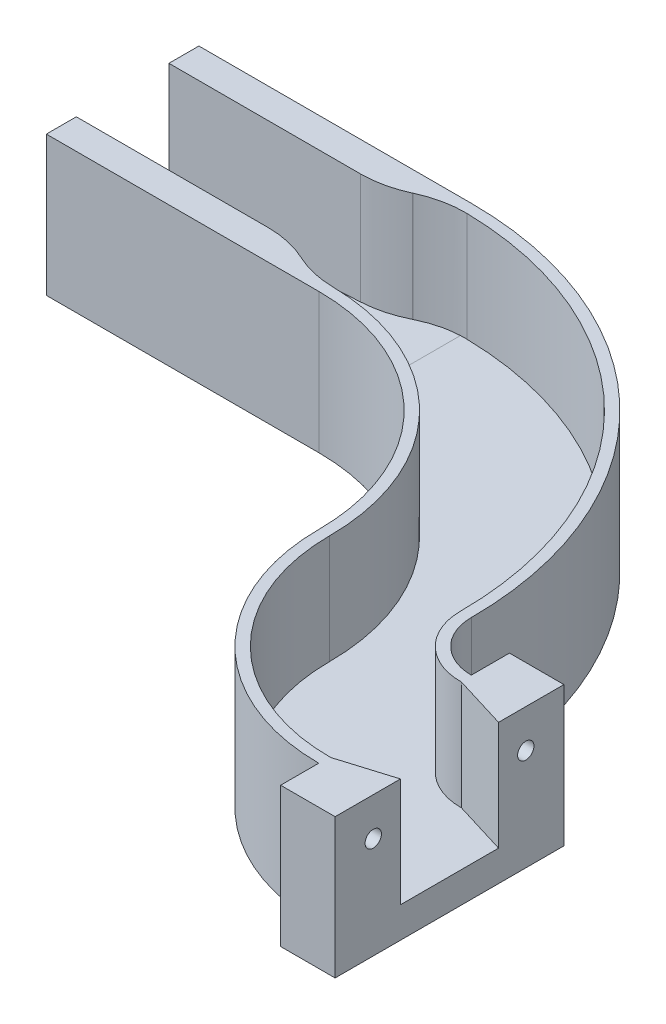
ISO-10303-21;
HEADER;
FILE_DESCRIPTION(('STEP AP214'),'2;1');
FILE_NAME('part.step','',(''),(''),'','','');
FILE_SCHEMA(('AUTOMOTIVE_DESIGN { 1 0 10303 214 1 1 1 1 }'));
ENDSEC;
DATA;
#1=APPLICATION_CONTEXT('core data for automotive mechanical design processes');
#2=APPLICATION_PROTOCOL_DEFINITION('international standard','automotive_design',2000,#1);
#3=PRODUCT_CONTEXT('',#1,'mechanical');
#4=PRODUCT('Part','Part','',(#3));
#5=PRODUCT_RELATED_PRODUCT_CATEGORY('part','',(#4));
#6=PRODUCT_DEFINITION_FORMATION('','',#4);
#7=PRODUCT_DEFINITION_CONTEXT('part definition',#1,'design');
#8=PRODUCT_DEFINITION('design','',#6,#7);
#9=PRODUCT_DEFINITION_SHAPE('','',#8);
#10=(LENGTH_UNIT() NAMED_UNIT(*) SI_UNIT(.MILLI.,.METRE.));
#11=(NAMED_UNIT(*) PLANE_ANGLE_UNIT() SI_UNIT($,.RADIAN.));
#12=(NAMED_UNIT(*) SI_UNIT($,.STERADIAN.) SOLID_ANGLE_UNIT());
#13=UNCERTAINTY_MEASURE_WITH_UNIT(LENGTH_MEASURE(1.E-05),#10,'distance_accuracy_value','');
#14=(GEOMETRIC_REPRESENTATION_CONTEXT(3) GLOBAL_UNCERTAINTY_ASSIGNED_CONTEXT((#13)) GLOBAL_UNIT_ASSIGNED_CONTEXT((#10,
#11,#12)) REPRESENTATION_CONTEXT('',''));
#15=CARTESIAN_POINT('',(0.,0.,0.));
#16=DIRECTION('',(0.,0.,1.));
#17=DIRECTION('',(1.,0.,0.));
#18=AXIS2_PLACEMENT_3D('',#15,#16,#17);
#19=CARTESIAN_POINT('',(-75.,35.,50.));
#20=DIRECTION('',(0.,-1.,0.));
#21=DIRECTION('',(0.,0.,-1.));
#22=AXIS2_PLACEMENT_3D('',#19,#20,#21);
#23=PLANE('',#22);
#24=CARTESIAN_POINT('',(-149.133179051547,35.,-9.49171374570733));
#25=DIRECTION('',(0.,-1.,0.));
#26=DIRECTION('',(0.,0.,-1.));
#27=AXIS2_PLACEMENT_3D('',#24,#25,#26);
#28=CIRCLE('',#27,18.5);
#29=CARTESIAN_POINT('',(-148.779515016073,34.9999999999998,-27.9883329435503));
#30=VERTEX_POINT('',#29);
#31=CARTESIAN_POINT('',(-149.972857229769,35.,-27.9726482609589));
#32=VERTEX_POINT('',#31);
#33=EDGE_CURVE('E448',#30,#32,#28,.F.);
#34=ORIENTED_EDGE('',*,*,#33,.T.);
#35=DIRECTION('',(0.,0.,1.));
#36=VECTOR('',#35,1.);
#37=CARTESIAN_POINT('',(-149.972857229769,35.,-7.50000000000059));
#38=LINE('',#37,#36);
#39=CARTESIAN_POINT('',(-149.972857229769,35.,-4.01364354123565));
#40=VERTEX_POINT('',#39);
#41=EDGE_CURVE('E476',#32,#40,#38,.T.);
#42=ORIENTED_EDGE('',*,*,#41,.T.);
#43=CARTESIAN_POINT('',(-149.100539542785,35.,-22.4930662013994));
#44=DIRECTION('',(0.,-1.,0.));
#45=DIRECTION('',(0.,0.,-1.));
#46=AXIS2_PLACEMENT_3D('',#43,#44,#45);
#47=CIRCLE('',#46,18.5);
#48=CARTESIAN_POINT('',(-149.385749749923,34.9999999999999,-3.99526484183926));
#49=VERTEX_POINT('',#48);
#50=EDGE_CURVE('E451',#40,#49,#47,.F.);
#51=ORIENTED_EDGE('',*,*,#50,.T.);
#52=CARTESIAN_POINT('',(-150.,34.9999999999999,35.8429976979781));
#53=DIRECTION('',(0.,-1.,0.));
#54=DIRECTION('',(1.,0.,0.));
#55=AXIS2_PLACEMENT_3D('',#52,#53,#54);
#56=CIRCLE('',#55,39.8429976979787);
#57=CARTESIAN_POINT('',(-110.157002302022,35.,35.8429976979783));
#58=VERTEX_POINT('',#57);
#59=EDGE_CURVE('E316',#49,#58,#56,.T.);
#60=ORIENTED_EDGE('',*,*,#59,.T.);
#61=CARTESIAN_POINT('',(-75.,35.,35.8429976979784));
#62=DIRECTION('',(0.,1.,0.));
#63=DIRECTION('',(0.,0.,1.));
#64=AXIS2_PLACEMENT_3D('',#61,#62,#63);
#65=CIRCLE('',#64,35.1570023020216);
#66=CARTESIAN_POINT('',(-74.8108943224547,35.,70.9994914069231));
#67=VERTEX_POINT('',#66);
#68=EDGE_CURVE('E355',#58,#67,#65,.T.);
#69=ORIENTED_EDGE('',*,*,#68,.T.);
#70=DIRECTION('',(-0.956304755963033,0.,0.292371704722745));
#71=VECTOR('',#70,1.);
#72=CARTESIAN_POINT('',(-69.1124517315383,35.,69.2573026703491));
#73=LINE('',#72,#71);
#74=CARTESIAN_POINT('',(-65.,35.,68.));
#75=VERTEX_POINT('',#74);
#76=EDGE_CURVE('E434',#67,#75,#73,.F.);
#77=ORIENTED_EDGE('',*,*,#76,.T.);
#78=DIRECTION('',(0.,0.,-1.));
#79=VECTOR('',#78,1.);
#80=CARTESIAN_POINT('',(-65.,35.,50.));
#81=LINE('',#80,#79);
#82=CARTESIAN_POINT('',(-65.,35.,50.));
#83=VERTEX_POINT('',#82);
#84=EDGE_CURVE('E403',#75,#83,#81,.T.);
#85=ORIENTED_EDGE('',*,*,#84,.T.);
#86=DIRECTION('',(0.956304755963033,0.,0.292371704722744));
#87=VECTOR('',#86,1.);
#88=CARTESIAN_POINT('',(-74.1451878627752,35.,47.2040354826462));
#89=LINE('',#88,#87);
#90=CARTESIAN_POINT('',(-74.8174433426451,35.,46.9985063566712));
#91=VERTEX_POINT('',#90);
#92=EDGE_CURVE('E428',#83,#91,#89,.F.);
#93=ORIENTED_EDGE('',*,*,#92,.T.);
#94=CARTESIAN_POINT('',(-75.,35.,35.8429976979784));
#95=DIRECTION('',(0.,1.,0.));
#96=DIRECTION('',(0.,0.,1.));
#97=AXIS2_PLACEMENT_3D('',#94,#95,#96);
#98=CIRCLE('',#97,11.1570023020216);
#99=CARTESIAN_POINT('',(-86.1570023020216,35.,35.8429976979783));
#100=VERTEX_POINT('',#99);
#101=EDGE_CURVE('E357',#100,#91,#98,.T.);
#102=ORIENTED_EDGE('',*,*,#101,.F.);
#103=CARTESIAN_POINT('',(-150.,34.9999999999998,35.8429976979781));
#104=DIRECTION('',(0.,-1.,0.));
#105=DIRECTION('',(1.,0.,0.));
#106=AXIS2_PLACEMENT_3D('',#103,#104,#105);
#107=CIRCLE('',#106,63.8429976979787);
#108=EDGE_CURVE('E318',#30,#100,#107,.T.);
#109=ORIENTED_EDGE('',*,*,#108,.F.);
#110=EDGE_LOOP('',(#34,#42,#51,#60,#69,#77,#85,#93,#102,#109));
#111=FACE_BOUND('',#110,.T.);
#112=ADVANCED_FACE('F35',(#111),#23,.F.);
#113=CARTESIAN_POINT('',(-75.,0.,0.));
#114=DIRECTION('',(1.,0.,0.));
#115=DIRECTION('',(0.,0.,-1.));
#116=AXIS2_PLACEMENT_3D('',#113,#114,#115);
#117=PLANE('',#116);
#118=DIRECTION('',(0.,-1.,0.));
#119=VECTOR('',#118,1.);
#120=CARTESIAN_POINT('',(-75.,29.3580211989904,45.));
#121=LINE('',#120,#119);
#122=CARTESIAN_POINT('',(-75.,55.,45.));
#123=VERTEX_POINT('',#122);
#124=CARTESIAN_POINT('',(-75.,49.5,45.));
#125=VERTEX_POINT('',#124);
#126=EDGE_CURVE('E323',#123,#125,#121,.T.);
#127=ORIENTED_EDGE('',*,*,#126,.F.);
#128=DIRECTION('',(0.,0.,-1.));
#129=VECTOR('',#128,1.);
#130=CARTESIAN_POINT('',(-75.,55.,38.));
#131=LINE('',#130,#129);
#132=CARTESIAN_POINT('',(-75.,55.,38.));
#133=VERTEX_POINT('',#132);
#134=EDGE_CURVE('E390',#123,#133,#131,.T.);
#135=ORIENTED_EDGE('',*,*,#134,.T.);
#136=DIRECTION('',(0.,-1.,0.));
#137=VECTOR('',#136,1.);
#138=CARTESIAN_POINT('',(-75.,29.3580211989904,38.));
#139=LINE('',#138,#137);
#140=CARTESIAN_POINT('',(-75.,29.3580211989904,38.));
#141=VERTEX_POINT('',#140);
#142=EDGE_CURVE('E379',#133,#141,#139,.T.);
#143=ORIENTED_EDGE('',*,*,#142,.T.);
#144=DIRECTION('',(0.,0.,1.));
#145=VECTOR('',#144,1.);
#146=CARTESIAN_POINT('',(-75.,29.3580211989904,80.));
#147=LINE('',#146,#145);
#148=CARTESIAN_POINT('',(-75.,29.3580211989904,45.));
#149=VERTEX_POINT('',#148);
#150=EDGE_CURVE('E384',#141,#149,#147,.T.);
#151=ORIENTED_EDGE('',*,*,#150,.T.);
#152=CARTESIAN_POINT('',(-75.,46.5,45.));
#153=VERTEX_POINT('',#152);
#154=EDGE_CURVE('E327',#153,#149,#121,.T.);
#155=ORIENTED_EDGE('',*,*,#154,.F.);
#156=CARTESIAN_POINT('',(-75.,48.,45.));
#157=DIRECTION('',(-1.,0.,0.));
#158=DIRECTION('',(0.,0.,1.));
#159=AXIS2_PLACEMENT_3D('',#156,#157,#158);
#160=CIRCLE('',#159,1.5);
#161=EDGE_CURVE('E372',#125,#153,#160,.T.);
#162=ORIENTED_EDGE('',*,*,#161,.F.);
#163=EDGE_LOOP('',(#127,#135,#143,#151,#155,#162));
#164=FACE_BOUND('',#163,.T.);
#165=ADVANCED_FACE('F536',(#164),#117,.F.);
#166=DIRECTION('',(0.,1.,0.));
#167=VECTOR('',#166,1.);
#168=CARTESIAN_POINT('',(-75.,55.,73.));
#169=LINE('',#168,#167);
#170=CARTESIAN_POINT('',(-75.,29.3580211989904,73.));
#171=VERTEX_POINT('',#170);
#172=CARTESIAN_POINT('',(-75.,46.5,73.));
#173=VERTEX_POINT('',#172);
#174=EDGE_CURVE('E328',#171,#173,#169,.T.);
#175=ORIENTED_EDGE('',*,*,#174,.F.);
#176=CARTESIAN_POINT('',(-75.,29.3580211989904,80.));
#177=VERTEX_POINT('',#176);
#178=EDGE_CURVE('E382',#171,#177,#147,.T.);
#179=ORIENTED_EDGE('',*,*,#178,.T.);
#180=DIRECTION('',(0.,1.,0.));
#181=VECTOR('',#180,1.);
#182=CARTESIAN_POINT('',(-75.,55.,80.));
#183=LINE('',#182,#181);
#184=CARTESIAN_POINT('',(-75.,55.,80.));
#185=VERTEX_POINT('',#184);
#186=EDGE_CURVE('E386',#177,#185,#183,.T.);
#187=ORIENTED_EDGE('',*,*,#186,.T.);
#188=DIRECTION('',(0.,0.,-1.));
#189=VECTOR('',#188,1.);
#190=CARTESIAN_POINT('',(-75.,55.,68.));
#191=LINE('',#190,#189);
#192=CARTESIAN_POINT('',(-75.,55.,73.));
#193=VERTEX_POINT('',#192);
#194=EDGE_CURVE('E388',#185,#193,#191,.T.);
#195=ORIENTED_EDGE('',*,*,#194,.T.);
#196=CARTESIAN_POINT('',(-75.,49.5,73.));
#197=VERTEX_POINT('',#196);
#198=EDGE_CURVE('E332',#197,#193,#169,.T.);
#199=ORIENTED_EDGE('',*,*,#198,.F.);
#200=CARTESIAN_POINT('',(-75.,48.,73.));
#201=DIRECTION('',(-1.,0.,0.));
#202=DIRECTION('',(0.,0.,1.));
#203=AXIS2_PLACEMENT_3D('',#200,#201,#202);
#204=CIRCLE('',#203,1.5);
#205=EDGE_CURVE('E369',#173,#197,#204,.T.);
#206=ORIENTED_EDGE('',*,*,#205,.F.);
#207=EDGE_LOOP('',(#175,#179,#187,#195,#199,#206));
#208=FACE_BOUND('',#207,.T.);
#209=ADVANCED_FACE('F542',(#208),#117,.F.);
#210=CARTESIAN_POINT('',(-65.,0.,0.));
#211=DIRECTION('',(1.,0.,0.));
#212=DIRECTION('',(0.,0.,-1.));
#213=AXIS2_PLACEMENT_3D('',#210,#211,#212);
#214=PLANE('',#213);
#215=DIRECTION('',(0.,1.,0.));
#216=VECTOR('',#215,1.);
#217=CARTESIAN_POINT('',(-65.,55.,80.));
#218=LINE('',#217,#216);
#219=CARTESIAN_POINT('',(-65.,29.3580211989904,80.));
#220=VERTEX_POINT('',#219);
#221=CARTESIAN_POINT('',(-65.,55.,80.));
#222=VERTEX_POINT('',#221);
#223=EDGE_CURVE('E397',#220,#222,#218,.T.);
#224=ORIENTED_EDGE('',*,*,#223,.F.);
#225=DIRECTION('',(0.,0.,1.));
#226=VECTOR('',#225,1.);
#227=CARTESIAN_POINT('',(-65.,29.3580211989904,80.));
#228=LINE('',#227,#226);
#229=CARTESIAN_POINT('',(-65.,29.3580211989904,38.));
#230=VERTEX_POINT('',#229);
#231=EDGE_CURVE('E395',#230,#220,#228,.T.);
#232=ORIENTED_EDGE('',*,*,#231,.F.);
#233=DIRECTION('',(0.,-1.,0.));
#234=VECTOR('',#233,1.);
#235=CARTESIAN_POINT('',(-65.,29.3580211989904,38.));
#236=LINE('',#235,#234);
#237=CARTESIAN_POINT('',(-65.,55.,38.));
#238=VERTEX_POINT('',#237);
#239=EDGE_CURVE('E375',#238,#230,#236,.T.);
#240=ORIENTED_EDGE('',*,*,#239,.F.);
#241=DIRECTION('',(0.,0.,-1.));
#242=VECTOR('',#241,1.);
#243=CARTESIAN_POINT('',(-65.,55.,38.));
#244=LINE('',#243,#242);
#245=CARTESIAN_POINT('',(-65.,55.,50.));
#246=VERTEX_POINT('',#245);
#247=EDGE_CURVE('E383',#246,#238,#244,.T.);
#248=ORIENTED_EDGE('',*,*,#247,.F.);
#249=DIRECTION('',(0.,1.,0.));
#250=VECTOR('',#249,1.);
#251=CARTESIAN_POINT('',(-65.,55.,50.));
#252=LINE('',#251,#250);
#253=EDGE_CURVE('E406',#83,#246,#252,.T.);
#254=ORIENTED_EDGE('',*,*,#253,.F.);
#255=ORIENTED_EDGE('',*,*,#84,.F.);
#256=DIRECTION('',(0.,-1.,0.));
#257=VECTOR('',#256,1.);
#258=CARTESIAN_POINT('',(-65.,35.,68.));
#259=LINE('',#258,#257);
#260=CARTESIAN_POINT('',(-65.,55.,68.));
#261=VERTEX_POINT('',#260);
#262=EDGE_CURVE('E400',#261,#75,#259,.T.);
#263=ORIENTED_EDGE('',*,*,#262,.F.);
#264=DIRECTION('',(0.,0.,-1.));
#265=VECTOR('',#264,1.);
#266=CARTESIAN_POINT('',(-65.,55.,68.));
#267=LINE('',#266,#265);
#268=EDGE_CURVE('E40',#222,#261,#267,.T.);
#269=ORIENTED_EDGE('',*,*,#268,.F.);
#270=EDGE_LOOP('',(#224,#232,#240,#248,#254,#255,#263,#269));
#271=FACE_BOUND('',#270,.T.);
#272=CARTESIAN_POINT('',(-65.,48.,45.));
#273=DIRECTION('',(-1.,0.,0.));
#274=DIRECTION('',(0.,0.,1.));
#275=AXIS2_PLACEMENT_3D('',#272,#273,#274);
#276=CIRCLE('',#275,1.5);
#277=CARTESIAN_POINT('',(-65.,48.,46.5));
#278=VERTEX_POINT('',#277);
#279=EDGE_CURVE('E368',#278,#278,#276,.T.);
#280=ORIENTED_EDGE('',*,*,#279,.T.);
#281=EDGE_LOOP('',(#280));
#282=FACE_BOUND('',#281,.T.);
#283=CARTESIAN_POINT('',(-65.,48.,73.));
#284=DIRECTION('',(-1.,0.,0.));
#285=DIRECTION('',(0.,0.,1.));
#286=AXIS2_PLACEMENT_3D('',#283,#284,#285);
#287=CIRCLE('',#286,1.5);
#288=CARTESIAN_POINT('',(-65.,48.,74.5));
#289=VERTEX_POINT('',#288);
#290=EDGE_CURVE('E364',#289,#289,#287,.T.);
#291=ORIENTED_EDGE('',*,*,#290,.T.);
#292=EDGE_LOOP('',(#291));
#293=FACE_BOUND('',#292,.T.);
#294=ADVANCED_FACE('F562',(#271,#282,#293),#214,.T.);
#295=CARTESIAN_POINT('',(-75.,29.3580211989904,38.));
#296=DIRECTION('',(0.,0.,1.));
#297=DIRECTION('',(1.,0.,0.));
#298=AXIS2_PLACEMENT_3D('',#295,#296,#297);
#299=PLANE('',#298);
#300=ORIENTED_EDGE('',*,*,#239,.T.);
#301=DIRECTION('',(1.,0.,0.));
#302=VECTOR('',#301,1.);
#303=CARTESIAN_POINT('',(-75.,29.3580211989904,38.));
#304=LINE('',#303,#302);
#305=EDGE_CURVE('E418',#141,#230,#304,.T.);
#306=ORIENTED_EDGE('',*,*,#305,.F.);
#307=ORIENTED_EDGE('',*,*,#142,.F.);
#308=DIRECTION('',(1.,0.,0.));
#309=VECTOR('',#308,1.);
#310=CARTESIAN_POINT('',(-75.,55.,38.));
#311=LINE('',#310,#309);
#312=EDGE_CURVE('E392',#133,#238,#311,.T.);
#313=ORIENTED_EDGE('',*,*,#312,.T.);
#314=EDGE_LOOP('',(#300,#306,#307,#313));
#315=FACE_BOUND('',#314,.T.);
#316=ADVANCED_FACE('F558',(#315),#299,.F.);
#317=CARTESIAN_POINT('',(-75.,29.3580211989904,80.));
#318=DIRECTION('',(0.,1.,0.));
#319=DIRECTION('',(0.,0.,1.));
#320=AXIS2_PLACEMENT_3D('',#317,#318,#319);
#321=PLANE('',#320);
#322=ORIENTED_EDGE('',*,*,#231,.T.);
#323=DIRECTION('',(1.,0.,0.));
#324=VECTOR('',#323,1.);
#325=CARTESIAN_POINT('',(-75.,29.3580211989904,80.));
#326=LINE('',#325,#324);
#327=EDGE_CURVE('E415',#177,#220,#326,.T.);
#328=ORIENTED_EDGE('',*,*,#327,.F.);
#329=ORIENTED_EDGE('',*,*,#178,.F.);
#330=CARTESIAN_POINT('',(-75.,29.3580211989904,35.8429976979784));
#331=DIRECTION('',(0.,1.,0.));
#332=DIRECTION('',(0.,0.,1.));
#333=AXIS2_PLACEMENT_3D('',#330,#331,#332);
#334=CIRCLE('',#333,37.1570023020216);
#335=CARTESIAN_POINT('',(-112.157002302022,29.3580211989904,35.8429976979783));
#336=VERTEX_POINT('',#335);
#337=EDGE_CURVE('E347',#336,#171,#334,.T.);
#338=ORIENTED_EDGE('',*,*,#337,.F.);
#339=CARTESIAN_POINT('',(-150.,29.3580211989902,35.8429976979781));
#340=DIRECTION('',(0.,-1.,0.));
#341=DIRECTION('',(1.,0.,0.));
#342=AXIS2_PLACEMENT_3D('',#339,#340,#341);
#343=CIRCLE('',#342,37.8429976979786);
#344=CARTESIAN_POINT('',(-150.,29.3580211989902,-2.0000000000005));
#345=VERTEX_POINT('',#344);
#346=EDGE_CURVE('E308',#345,#336,#343,.T.);
#347=ORIENTED_EDGE('',*,*,#346,.F.);
#348=DIRECTION('',(1.,0.,0.));
#349=VECTOR('',#348,1.);
#350=CARTESIAN_POINT('',(-200.,29.3580211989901,-2.0000000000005));
#351=LINE('',#350,#349);
#352=CARTESIAN_POINT('',(-200.,29.3580211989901,-2.0000000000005));
#353=VERTEX_POINT('',#352);
#354=EDGE_CURVE('E287',#353,#345,#351,.T.);
#355=ORIENTED_EDGE('',*,*,#354,.F.);
#356=DIRECTION('',(0.,0.,1.));
#357=VECTOR('',#356,1.);
#358=CARTESIAN_POINT('',(-200.,29.35802119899,-30.0000000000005));
#359=LINE('',#358,#357);
#360=CARTESIAN_POINT('',(-200.,29.35802119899,-30.0000000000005));
#361=VERTEX_POINT('',#360);
#362=EDGE_CURVE('E283',#361,#353,#359,.T.);
#363=ORIENTED_EDGE('',*,*,#362,.F.);
#364=DIRECTION('',(1.,0.,0.));
#365=VECTOR('',#364,1.);
#366=CARTESIAN_POINT('',(-200.,29.35802119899,-30.0000000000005));
#367=LINE('',#366,#365);
#368=CARTESIAN_POINT('',(-150.,29.3580211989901,-30.0000000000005));
#369=VERTEX_POINT('',#368);
#370=EDGE_CURVE('E290',#361,#369,#367,.T.);
#371=ORIENTED_EDGE('',*,*,#370,.T.);
#372=CARTESIAN_POINT('',(-150.,29.3580211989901,35.8429976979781));
#373=DIRECTION('',(0.,-1.,0.));
#374=DIRECTION('',(1.,0.,0.));
#375=AXIS2_PLACEMENT_3D('',#372,#373,#374);
#376=CIRCLE('',#375,65.8429976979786);
#377=CARTESIAN_POINT('',(-84.1570023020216,29.3580211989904,35.8429976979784));
#378=VERTEX_POINT('',#377);
#379=EDGE_CURVE('E305',#369,#378,#376,.T.);
#380=ORIENTED_EDGE('',*,*,#379,.T.);
#381=CARTESIAN_POINT('',(-75.,29.3580211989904,35.8429976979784));
#382=DIRECTION('',(0.,1.,0.));
#383=DIRECTION('',(0.,0.,1.));
#384=AXIS2_PLACEMENT_3D('',#381,#382,#383);
#385=CIRCLE('',#384,9.15700230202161);
#386=EDGE_CURVE('E344',#378,#149,#385,.T.);
#387=ORIENTED_EDGE('',*,*,#386,.T.);
#388=ORIENTED_EDGE('',*,*,#150,.F.);
#389=ORIENTED_EDGE('',*,*,#305,.T.);
#390=EDGE_LOOP('',(#322,#328,#329,#338,#347,#355,#363,#371,#380,#387,#388,#389));
#391=FACE_BOUND('',#390,.T.);
#392=ADVANCED_FACE('F554',(#391),#321,.F.);
#393=CARTESIAN_POINT('',(-75.,55.,80.));
#394=DIRECTION('',(0.,0.,-1.));
#395=DIRECTION('',(-1.,0.,0.));
#396=AXIS2_PLACEMENT_3D('',#393,#394,#395);
#397=PLANE('',#396);
#398=ORIENTED_EDGE('',*,*,#223,.T.);
#399=DIRECTION('',(1.,0.,0.));
#400=VECTOR('',#399,1.);
#401=CARTESIAN_POINT('',(-75.,55.,80.));
#402=LINE('',#401,#400);
#403=EDGE_CURVE('E412',#185,#222,#402,.T.);
#404=ORIENTED_EDGE('',*,*,#403,.F.);
#405=ORIENTED_EDGE('',*,*,#186,.F.);
#406=ORIENTED_EDGE('',*,*,#327,.T.);
#407=EDGE_LOOP('',(#398,#404,#405,#406));
#408=FACE_BOUND('',#407,.T.);
#409=ADVANCED_FACE('F551',(#408),#397,.F.);
#410=CARTESIAN_POINT('',(-75.,55.,68.));
#411=DIRECTION('',(0.,-1.,0.));
#412=DIRECTION('',(0.,0.,-1.));
#413=AXIS2_PLACEMENT_3D('',#410,#411,#412);
#414=PLANE('',#413);
#415=DIRECTION('',(-0.906307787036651,0.,-0.422618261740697));
#416=VECTOR('',#415,1.);
#417=CARTESIAN_POINT('',(-160.722534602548,55.,-7.50000000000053));
#418=LINE('',#417,#416);
#419=CARTESIAN_POINT('',(-156.918977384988,55.,-5.72637214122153));
#420=VERTEX_POINT('',#419);
#421=CARTESIAN_POINT('',(-157.00544801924,55.,-5.76669406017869));
#422=VERTEX_POINT('',#421);
#423=EDGE_CURVE('E436',#420,#422,#418,.T.);
#424=ORIENTED_EDGE('',*,*,#423,.T.);
#425=CARTESIAN_POINT('',(-164.823885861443,55.,10.9999999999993));
#426=DIRECTION('',(0.,-1.,0.));
#427=DIRECTION('',(0.,0.,-1.));
#428=AXIS2_PLACEMENT_3D('',#425,#426,#427);
#429=CIRCLE('',#428,18.5);
#430=CARTESIAN_POINT('',(-164.823885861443,54.9999999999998,-7.50000000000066));
#431=VERTEX_POINT('',#430);
#432=EDGE_CURVE('E273',#422,#431,#429,.F.);
#433=ORIENTED_EDGE('',*,*,#432,.T.);
#434=DIRECTION('',(1.,0.,0.));
#435=VECTOR('',#434,1.);
#436=CARTESIAN_POINT('',(-200.,54.9999999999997,-7.50000000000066));
#437=LINE('',#436,#435);
#438=CARTESIAN_POINT('',(-200.,54.9999999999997,-7.50000000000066));
#439=VERTEX_POINT('',#438);
#440=EDGE_CURVE('E264',#439,#431,#437,.T.);
#441=ORIENTED_EDGE('',*,*,#440,.F.);
#442=DIRECTION('',(0.,0.,-1.));
#443=VECTOR('',#442,1.);
#444=CARTESIAN_POINT('',(-200.,54.9999999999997,-2.0000000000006));
#445=LINE('',#444,#443);
#446=CARTESIAN_POINT('',(-200.,54.9999999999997,-2.0000000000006));
#447=VERTEX_POINT('',#446);
#448=EDGE_CURVE('E247',#447,#439,#445,.T.);
#449=ORIENTED_EDGE('',*,*,#448,.F.);
#450=DIRECTION('',(1.,0.,0.));
#451=VECTOR('',#450,1.);
#452=CARTESIAN_POINT('',(-200.,54.9999999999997,-2.0000000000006));
#453=LINE('',#452,#451);
#454=CARTESIAN_POINT('',(-150.,54.9999999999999,-2.0000000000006));
#455=VERTEX_POINT('',#454);
#456=EDGE_CURVE('E259',#447,#455,#453,.T.);
#457=ORIENTED_EDGE('',*,*,#456,.T.);
#458=CARTESIAN_POINT('',(-150.,54.9999999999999,35.8429976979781));
#459=DIRECTION('',(0.,-1.,0.));
#460=DIRECTION('',(1.,0.,0.));
#461=AXIS2_PLACEMENT_3D('',#458,#459,#460);
#462=CIRCLE('',#461,37.8429976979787);
#463=CARTESIAN_POINT('',(-112.157002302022,55.,35.8429976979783));
#464=VERTEX_POINT('',#463);
#465=EDGE_CURVE('E311',#455,#464,#462,.T.);
#466=ORIENTED_EDGE('',*,*,#465,.T.);
#467=CARTESIAN_POINT('',(-75.,55.,35.8429976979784));
#468=DIRECTION('',(0.,1.,0.));
#469=DIRECTION('',(0.,0.,1.));
#470=AXIS2_PLACEMENT_3D('',#467,#468,#469);
#471=CIRCLE('',#470,37.1570023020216);
#472=EDGE_CURVE('E350',#464,#193,#471,.T.);
#473=ORIENTED_EDGE('',*,*,#472,.T.);
#474=ORIENTED_EDGE('',*,*,#194,.F.);
#475=ORIENTED_EDGE('',*,*,#403,.T.);
#476=ORIENTED_EDGE('',*,*,#268,.T.);
#477=DIRECTION('',(0.956304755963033,0.,-0.292371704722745));
#478=VECTOR('',#477,1.);
#479=CARTESIAN_POINT('',(-75.,55.,71.0573068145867));
#480=LINE('',#479,#478);
#481=CARTESIAN_POINT('',(-74.8108943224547,55.,70.9994914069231));
#482=VERTEX_POINT('',#481);
#483=EDGE_CURVE('E422',#261,#482,#480,.F.);
#484=ORIENTED_EDGE('',*,*,#483,.T.);
#485=CARTESIAN_POINT('',(-75.,55.,35.8429976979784));
#486=DIRECTION('',(0.,1.,0.));
#487=DIRECTION('',(0.,0.,1.));
#488=AXIS2_PLACEMENT_3D('',#485,#486,#487);
#489=CIRCLE('',#488,35.1570023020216);
#490=CARTESIAN_POINT('',(-110.157002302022,55.,35.8429976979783));
#491=VERTEX_POINT('',#490);
#492=EDGE_CURVE('E353',#491,#482,#489,.T.);
#493=ORIENTED_EDGE('',*,*,#492,.F.);
#494=CARTESIAN_POINT('',(-150.,54.9999999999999,35.8429976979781));
#495=DIRECTION('',(0.,-1.,0.));
#496=DIRECTION('',(1.,0.,0.));
#497=AXIS2_PLACEMENT_3D('',#494,#495,#496);
#498=CIRCLE('',#497,39.8429976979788);
#499=CARTESIAN_POINT('',(-149.385749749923,54.9999999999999,-3.99526484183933));
#500=VERTEX_POINT('',#499);
#501=EDGE_CURVE('E314',#500,#491,#498,.T.);
#502=ORIENTED_EDGE('',*,*,#501,.F.);
#503=CARTESIAN_POINT('',(-149.100539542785,55.,-22.4930662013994));
#504=DIRECTION('',(0.,-1.,0.));
#505=DIRECTION('',(0.,0.,-1.));
#506=AXIS2_PLACEMENT_3D('',#503,#504,#505);
#507=CIRCLE('',#506,18.5);
#508=EDGE_CURVE('E466',#500,#420,#507,.T.);
#509=ORIENTED_EDGE('',*,*,#508,.T.);
#510=EDGE_LOOP('',(#424,#433,#441,#449,#457,#466,#473,#474,#475,#476,#484,#493,#502,#509));
#511=FACE_BOUND('',#510,.T.);
#512=ADVANCED_FACE('F271',(#511),#414,.F.);
#513=CARTESIAN_POINT('',(-75.,55.,38.));
#514=DIRECTION('',(0.,-1.,0.));
#515=DIRECTION('',(0.,0.,-1.));
#516=AXIS2_PLACEMENT_3D('',#513,#514,#515);
#517=PLANE('',#516);
#518=DIRECTION('',(-1.,0.,0.));
#519=VECTOR('',#518,1.);
#520=CARTESIAN_POINT('',(-150.,54.9999999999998,-24.5000000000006));
#521=LINE('',#520,#519);
#522=CARTESIAN_POINT('',(-164.823885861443,54.9999999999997,-24.5000000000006));
#523=VERTEX_POINT('',#522);
#524=CARTESIAN_POINT('',(-200.,54.9999999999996,-24.5000000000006));
#525=VERTEX_POINT('',#524);
#526=EDGE_CURVE('E268',#523,#525,#521,.T.);
#527=ORIENTED_EDGE('',*,*,#526,.F.);
#528=CARTESIAN_POINT('',(-164.823885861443,55.,-43.0000000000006));
#529=DIRECTION('',(0.,-1.,0.));
#530=DIRECTION('',(0.,0.,-1.));
#531=AXIS2_PLACEMENT_3D('',#528,#529,#530);
#532=CIRCLE('',#531,18.5);
#533=CARTESIAN_POINT('',(-157.00544801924,55.,-26.2333059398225));
#534=VERTEX_POINT('',#533);
#535=EDGE_CURVE('E459',#523,#534,#532,.F.);
#536=ORIENTED_EDGE('',*,*,#535,.T.);
#537=DIRECTION('',(0.906307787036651,0.,-0.422618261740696));
#538=VECTOR('',#537,1.);
#539=CARTESIAN_POINT('',(-160.722534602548,55.,-24.5000000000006));
#540=LINE('',#539,#538);
#541=CARTESIAN_POINT('',(-156.95161689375,55.,-26.2584078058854));
#542=VERTEX_POINT('',#541);
#543=EDGE_CURVE('E438',#534,#542,#540,.T.);
#544=ORIENTED_EDGE('',*,*,#543,.T.);
#545=CARTESIAN_POINT('',(-149.133179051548,55.,-9.49171374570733));
#546=DIRECTION('',(0.,-1.,0.));
#547=DIRECTION('',(0.,0.,-1.));
#548=AXIS2_PLACEMENT_3D('',#545,#546,#547);
#549=CIRCLE('',#548,18.5);
#550=CARTESIAN_POINT('',(-148.779515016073,54.9999999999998,-27.9883329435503));
#551=VERTEX_POINT('',#550);
#552=EDGE_CURVE('E468',#542,#551,#549,.T.);
#553=ORIENTED_EDGE('',*,*,#552,.T.);
#554=CARTESIAN_POINT('',(-150.,54.9999999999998,35.8429976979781));
#555=DIRECTION('',(0.,-1.,0.));
#556=DIRECTION('',(1.,0.,0.));
#557=AXIS2_PLACEMENT_3D('',#554,#555,#556);
#558=CIRCLE('',#557,63.8429976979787);
#559=CARTESIAN_POINT('',(-86.1570023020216,55.,35.8429976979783));
#560=VERTEX_POINT('',#559);
#561=EDGE_CURVE('E320',#551,#560,#558,.T.);
#562=ORIENTED_EDGE('',*,*,#561,.T.);
#563=CARTESIAN_POINT('',(-75.,55.,35.8429976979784));
#564=DIRECTION('',(0.,1.,0.));
#565=DIRECTION('',(0.,0.,1.));
#566=AXIS2_PLACEMENT_3D('',#563,#564,#565);
#567=CIRCLE('',#566,11.1570023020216);
#568=CARTESIAN_POINT('',(-74.8174433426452,55.,46.9985063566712));
#569=VERTEX_POINT('',#568);
#570=EDGE_CURVE('E359',#560,#569,#567,.T.);
#571=ORIENTED_EDGE('',*,*,#570,.T.);
#572=DIRECTION('',(-0.956304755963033,0.,-0.292371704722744));
#573=VECTOR('',#572,1.);
#574=CARTESIAN_POINT('',(-75.,55.,46.9426931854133));
#575=LINE('',#574,#573);
#576=EDGE_CURVE('E420',#569,#246,#575,.F.);
#577=ORIENTED_EDGE('',*,*,#576,.T.);
#578=ORIENTED_EDGE('',*,*,#247,.T.);
#579=ORIENTED_EDGE('',*,*,#312,.F.);
#580=ORIENTED_EDGE('',*,*,#134,.F.);
#581=CARTESIAN_POINT('',(-75.,55.,35.8429976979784));
#582=DIRECTION('',(0.,1.,0.));
#583=DIRECTION('',(0.,0.,1.));
#584=AXIS2_PLACEMENT_3D('',#581,#582,#583);
#585=CIRCLE('',#584,9.15700230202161);
#586=CARTESIAN_POINT('',(-84.1570023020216,55.,35.8429976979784));
#587=VERTEX_POINT('',#586);
#588=EDGE_CURVE('E361',#587,#123,#585,.T.);
#589=ORIENTED_EDGE('',*,*,#588,.F.);
#590=CARTESIAN_POINT('',(-150.,54.9999999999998,35.8429976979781));
#591=DIRECTION('',(0.,-1.,0.));
#592=DIRECTION('',(1.,0.,0.));
#593=AXIS2_PLACEMENT_3D('',#590,#591,#592);
#594=CIRCLE('',#593,65.8429976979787);
#595=CARTESIAN_POINT('',(-150.,54.9999999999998,-30.0000000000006));
#596=VERTEX_POINT('',#595);
#597=EDGE_CURVE('E302',#596,#587,#594,.T.);
#598=ORIENTED_EDGE('',*,*,#597,.F.);
#599=DIRECTION('',(1.,0.,0.));
#600=VECTOR('',#599,1.);
#601=CARTESIAN_POINT('',(-200.,54.9999999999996,-30.0000000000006));
#602=LINE('',#601,#600);
#603=CARTESIAN_POINT('',(-200.,54.9999999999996,-30.0000000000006));
#604=VERTEX_POINT('',#603);
#605=EDGE_CURVE('E293',#604,#596,#602,.T.);
#606=ORIENTED_EDGE('',*,*,#605,.F.);
#607=DIRECTION('',(0.,0.,-1.));
#608=VECTOR('',#607,1.);
#609=CARTESIAN_POINT('',(-200.,54.9999999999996,-28.0000000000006));
#610=LINE('',#609,#608);
#611=EDGE_CURVE('E279',#525,#604,#610,.T.);
#612=ORIENTED_EDGE('',*,*,#611,.F.);
#613=EDGE_LOOP('',(#527,#536,#544,#553,#562,#571,#577,#578,#579,#580,#589,#598,#606,#612));
#614=FACE_BOUND('',#613,.T.);
#615=ADVANCED_FACE('F547',(#614),#517,.F.);
#616=CARTESIAN_POINT('',(-75.,48.,45.));
#617=DIRECTION('',(1.,0.,0.));
#618=DIRECTION('',(0.,0.,-1.));
#619=AXIS2_PLACEMENT_3D('',#616,#617,#618);
#620=CYLINDRICAL_SURFACE('',#619,1.5);
#621=ORIENTED_EDGE('',*,*,#161,.T.);
#622=EDGE_CURVE('E376',#153,#125,#160,.T.);
#623=ORIENTED_EDGE('',*,*,#622,.T.);
#624=EDGE_LOOP('',(#621,#623));
#625=FACE_BOUND('',#624,.T.);
#626=ORIENTED_EDGE('',*,*,#279,.F.);
#627=EDGE_LOOP('',(#626));
#628=FACE_BOUND('',#627,.T.);
#629=ADVANCED_FACE('F633',(#625,#628),#620,.F.);
#630=CARTESIAN_POINT('',(-75.,48.,73.));
#631=DIRECTION('',(1.,0.,0.));
#632=DIRECTION('',(0.,0.,-1.));
#633=AXIS2_PLACEMENT_3D('',#630,#631,#632);
#634=CYLINDRICAL_SURFACE('',#633,1.5);
#635=EDGE_CURVE('E365',#197,#173,#204,.T.);
#636=ORIENTED_EDGE('',*,*,#635,.T.);
#637=ORIENTED_EDGE('',*,*,#205,.T.);
#638=EDGE_LOOP('',(#636,#637));
#639=FACE_BOUND('',#638,.T.);
#640=ORIENTED_EDGE('',*,*,#290,.F.);
#641=EDGE_LOOP('',(#640));
#642=FACE_BOUND('',#641,.T.);
#643=ADVANCED_FACE('F660',(#639,#642),#634,.F.);
#644=CARTESIAN_POINT('',(-75.,0.,0.));
#645=DIRECTION('',(1.,0.,0.));
#646=DIRECTION('',(0.,0.,-1.));
#647=AXIS2_PLACEMENT_3D('',#644,#645,#646);
#648=PLANE('',#647);
#649=ORIENTED_EDGE('',*,*,#622,.F.);
#650=EDGE_CURVE('E322',#125,#153,#121,.T.);
#651=ORIENTED_EDGE('',*,*,#650,.F.);
#652=EDGE_LOOP('',(#649,#651));
#653=FACE_BOUND('',#652,.T.);
#654=ADVANCED_FACE('F630',(#653),#648,.T.);
#655=ORIENTED_EDGE('',*,*,#635,.F.);
#656=EDGE_CURVE('E326',#173,#197,#169,.T.);
#657=ORIENTED_EDGE('',*,*,#656,.F.);
#658=EDGE_LOOP('',(#655,#657));
#659=FACE_BOUND('',#658,.T.);
#660=ADVANCED_FACE('F659',(#659),#648,.T.);
#661=CARTESIAN_POINT('',(-75.,0.429999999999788,35.8429976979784));
#662=DIRECTION('',(0.,1.,0.));
#663=DIRECTION('',(0.,0.,1.));
#664=AXIS2_PLACEMENT_3D('',#661,#662,#663);
#665=CYLINDRICAL_SURFACE('',#664,9.15700230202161);
#666=ORIENTED_EDGE('',*,*,#588,.T.);
#667=ORIENTED_EDGE('',*,*,#126,.T.);
#668=ORIENTED_EDGE('',*,*,#650,.T.);
#669=ORIENTED_EDGE('',*,*,#154,.T.);
#670=ORIENTED_EDGE('',*,*,#386,.F.);
#671=DIRECTION('',(0.,-1.,0.));
#672=VECTOR('',#671,1.);
#673=CARTESIAN_POINT('',(-84.1570023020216,29.3580211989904,35.8429976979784));
#674=LINE('',#673,#672);
#675=EDGE_CURVE('E331',#587,#378,#674,.T.);
#676=ORIENTED_EDGE('',*,*,#675,.F.);
#677=EDGE_LOOP('',(#666,#667,#668,#669,#670,#676));
#678=FACE_BOUND('',#677,.T.);
#679=ADVANCED_FACE('F627',(#678),#665,.F.);
#680=CARTESIAN_POINT('',(-75.,0.429999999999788,35.8429976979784));
#681=DIRECTION('',(0.,1.,0.));
#682=DIRECTION('',(0.,0.,1.));
#683=AXIS2_PLACEMENT_3D('',#680,#681,#682);
#684=CYLINDRICAL_SURFACE('',#683,11.1570023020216);
#685=ORIENTED_EDGE('',*,*,#101,.T.);
#686=DIRECTION('',(0.,1.,0.));
#687=VECTOR('',#686,1.);
#688=CARTESIAN_POINT('',(-74.8174433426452,45.,46.9985063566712));
#689=LINE('',#688,#687);
#690=EDGE_CURVE('E425',#91,#569,#689,.T.);
#691=ORIENTED_EDGE('',*,*,#690,.T.);
#692=ORIENTED_EDGE('',*,*,#570,.F.);
#693=DIRECTION('',(0.,1.,0.));
#694=VECTOR('',#693,1.);
#695=CARTESIAN_POINT('',(-86.1570023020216,55.,35.8429976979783));
#696=LINE('',#695,#694);
#697=EDGE_CURVE('E341',#100,#560,#696,.T.);
#698=ORIENTED_EDGE('',*,*,#697,.F.);
#699=EDGE_LOOP('',(#685,#691,#692,#698));
#700=FACE_BOUND('',#699,.T.);
#701=ADVANCED_FACE('F663',(#700),#684,.T.);
#702=CARTESIAN_POINT('',(-75.,0.429999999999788,35.8429976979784));
#703=DIRECTION('',(0.,1.,0.));
#704=DIRECTION('',(0.,0.,1.));
#705=AXIS2_PLACEMENT_3D('',#702,#703,#704);
#706=CYLINDRICAL_SURFACE('',#705,35.1570023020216);
#707=ORIENTED_EDGE('',*,*,#492,.T.);
#708=DIRECTION('',(0.,1.,0.));
#709=VECTOR('',#708,1.);
#710=CARTESIAN_POINT('',(-74.8108943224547,45.,70.9994914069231));
#711=LINE('',#710,#709);
#712=EDGE_CURVE('E431',#482,#67,#711,.F.);
#713=ORIENTED_EDGE('',*,*,#712,.T.);
#714=ORIENTED_EDGE('',*,*,#68,.F.);
#715=DIRECTION('',(0.,-1.,0.));
#716=VECTOR('',#715,1.);
#717=CARTESIAN_POINT('',(-110.157002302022,35.,35.8429976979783));
#718=LINE('',#717,#716);
#719=EDGE_CURVE('E338',#491,#58,#718,.T.);
#720=ORIENTED_EDGE('',*,*,#719,.F.);
#721=EDGE_LOOP('',(#707,#713,#714,#720));
#722=FACE_BOUND('',#721,.T.);
#723=ADVANCED_FACE('F666',(#722),#706,.F.);
#724=CARTESIAN_POINT('',(-75.,0.429999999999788,35.8429976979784));
#725=DIRECTION('',(0.,1.,0.));
#726=DIRECTION('',(0.,0.,1.));
#727=AXIS2_PLACEMENT_3D('',#724,#725,#726);
#728=CYLINDRICAL_SURFACE('',#727,37.1570023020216);
#729=ORIENTED_EDGE('',*,*,#337,.T.);
#730=ORIENTED_EDGE('',*,*,#174,.T.);
#731=ORIENTED_EDGE('',*,*,#656,.T.);
#732=ORIENTED_EDGE('',*,*,#198,.T.);
#733=ORIENTED_EDGE('',*,*,#472,.F.);
#734=DIRECTION('',(0.,1.,0.));
#735=VECTOR('',#734,1.);
#736=CARTESIAN_POINT('',(-112.157002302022,55.,35.8429976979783));
#737=LINE('',#736,#735);
#738=EDGE_CURVE('E335',#336,#464,#737,.T.);
#739=ORIENTED_EDGE('',*,*,#738,.F.);
#740=EDGE_LOOP('',(#729,#730,#731,#732,#733,#739));
#741=FACE_BOUND('',#740,.T.);
#742=ADVANCED_FACE('F617',(#741),#728,.T.);
#743=CARTESIAN_POINT('',(-150.,-5.2372220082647E-13,35.8429976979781));
#744=DIRECTION('',(0.,-1.,0.));
#745=DIRECTION('',(1.,0.,0.));
#746=AXIS2_PLACEMENT_3D('',#743,#744,#745);
#747=CYLINDRICAL_SURFACE('',#746,63.8429976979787);
#748=ORIENTED_EDGE('',*,*,#561,.F.);
#749=DIRECTION('',(0.,-1.,0.));
#750=VECTOR('',#749,1.);
#751=CARTESIAN_POINT('',(-148.779515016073,-5.19410803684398E-13,-27.9883329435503));
#752=LINE('',#751,#750);
#753=EDGE_CURVE('E463',#551,#30,#752,.T.);
#754=ORIENTED_EDGE('',*,*,#753,.T.);
#755=ORIENTED_EDGE('',*,*,#108,.T.);
#756=ORIENTED_EDGE('',*,*,#697,.T.);
#757=EDGE_LOOP('',(#748,#754,#755,#756));
#758=FACE_BOUND('',#757,.T.);
#759=ADVANCED_FACE('F652',(#758),#747,.F.);
#760=CARTESIAN_POINT('',(-150.,-5.2372220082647E-13,35.8429976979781));
#761=DIRECTION('',(0.,-1.,0.));
#762=DIRECTION('',(1.,0.,0.));
#763=AXIS2_PLACEMENT_3D('',#760,#761,#762);
#764=CYLINDRICAL_SURFACE('',#763,39.8429976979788);
#765=ORIENTED_EDGE('',*,*,#59,.F.);
#766=DIRECTION('',(0.,-1.,0.));
#767=VECTOR('',#766,1.);
#768=CARTESIAN_POINT('',(-149.385749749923,-5.21552344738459E-13,-3.9952648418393));
#769=LINE('',#768,#767);
#770=EDGE_CURVE('E441',#49,#500,#769,.F.);
#771=ORIENTED_EDGE('',*,*,#770,.T.);
#772=ORIENTED_EDGE('',*,*,#501,.T.);
#773=ORIENTED_EDGE('',*,*,#719,.T.);
#774=EDGE_LOOP('',(#765,#771,#772,#773));
#775=FACE_BOUND('',#774,.T.);
#776=ADVANCED_FACE('F645',(#775),#764,.T.);
#777=CARTESIAN_POINT('',(-150.,-5.2372220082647E-13,35.8429976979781));
#778=DIRECTION('',(0.,-1.,0.));
#779=DIRECTION('',(1.,0.,0.));
#780=AXIS2_PLACEMENT_3D('',#777,#778,#779);
#781=CYLINDRICAL_SURFACE('',#780,37.8429976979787);
#782=ORIENTED_EDGE('',*,*,#346,.T.);
#783=ORIENTED_EDGE('',*,*,#738,.T.);
#784=ORIENTED_EDGE('',*,*,#465,.F.);
#785=DIRECTION('',(0.,1.,0.));
#786=VECTOR('',#785,1.);
#787=CARTESIAN_POINT('',(-150.,29.3580211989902,-2.0000000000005));
#788=LINE('',#787,#786);
#789=EDGE_CURVE('E299',#345,#455,#788,.T.);
#790=ORIENTED_EDGE('',*,*,#789,.F.);
#791=EDGE_LOOP('',(#782,#783,#784,#790));
#792=FACE_BOUND('',#791,.T.);
#793=ADVANCED_FACE('F615',(#792),#781,.F.);
#794=CARTESIAN_POINT('',(-150.,-5.2372220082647E-13,35.8429976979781));
#795=DIRECTION('',(0.,-1.,0.));
#796=DIRECTION('',(1.,0.,0.));
#797=AXIS2_PLACEMENT_3D('',#794,#795,#796);
#798=CYLINDRICAL_SURFACE('',#797,65.8429976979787);
#799=DIRECTION('',(0.,-1.,0.));
#800=VECTOR('',#799,1.);
#801=CARTESIAN_POINT('',(-150.,54.9999999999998,-30.0000000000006));
#802=LINE('',#801,#800);
#803=EDGE_CURVE('E296',#596,#369,#802,.T.);
#804=ORIENTED_EDGE('',*,*,#803,.F.);
#805=ORIENTED_EDGE('',*,*,#597,.T.);
#806=ORIENTED_EDGE('',*,*,#675,.T.);
#807=ORIENTED_EDGE('',*,*,#379,.F.);
#808=EDGE_LOOP('',(#804,#805,#806,#807));
#809=FACE_BOUND('',#808,.T.);
#810=ADVANCED_FACE('F568',(#809),#798,.T.);
#811=CARTESIAN_POINT('',(-75.,0.,46.9426931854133));
#812=DIRECTION('',(0.292371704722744,0.,-0.956304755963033));
#813=DIRECTION('',(0.,1.,0.));
#814=AXIS2_PLACEMENT_3D('',#811,#812,#813);
#815=PLANE('',#814);
#816=ORIENTED_EDGE('',*,*,#92,.F.);
#817=ORIENTED_EDGE('',*,*,#253,.T.);
#818=ORIENTED_EDGE('',*,*,#576,.F.);
#819=ORIENTED_EDGE('',*,*,#690,.F.);
#820=EDGE_LOOP('',(#816,#817,#818,#819));
#821=FACE_BOUND('',#820,.T.);
#822=ADVANCED_FACE('F564',(#821),#815,.F.);
#823=CARTESIAN_POINT('',(-75.,0.,71.0573068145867));
#824=DIRECTION('',(0.292371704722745,0.,0.956304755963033));
#825=DIRECTION('',(0.,-1.,0.));
#826=AXIS2_PLACEMENT_3D('',#823,#824,#825);
#827=PLANE('',#826);
#828=ORIENTED_EDGE('',*,*,#483,.F.);
#829=ORIENTED_EDGE('',*,*,#262,.T.);
#830=ORIENTED_EDGE('',*,*,#76,.F.);
#831=ORIENTED_EDGE('',*,*,#712,.F.);
#832=EDGE_LOOP('',(#828,#829,#830,#831));
#833=FACE_BOUND('',#832,.T.);
#834=ADVANCED_FACE('F567',(#833),#827,.F.);
#835=CARTESIAN_POINT('',(-200.,54.9999999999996,-30.0000000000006));
#836=DIRECTION('',(0.,0.,1.));
#837=DIRECTION('',(0.,-1.,0.));
#838=AXIS2_PLACEMENT_3D('',#835,#836,#837);
#839=PLANE('',#838);
#840=ORIENTED_EDGE('',*,*,#803,.T.);
#841=ORIENTED_EDGE('',*,*,#370,.F.);
#842=DIRECTION('',(0.,-1.,0.));
#843=VECTOR('',#842,1.);
#844=CARTESIAN_POINT('',(-200.,54.9999999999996,-30.0000000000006));
#845=LINE('',#844,#843);
#846=EDGE_CURVE('E281',#604,#361,#845,.T.);
#847=ORIENTED_EDGE('',*,*,#846,.F.);
#848=ORIENTED_EDGE('',*,*,#605,.T.);
#849=EDGE_LOOP('',(#840,#841,#847,#848));
#850=FACE_BOUND('',#849,.T.);
#851=ADVANCED_FACE('F571',(#850),#839,.F.);
#852=CARTESIAN_POINT('',(-200.,29.3580211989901,-2.0000000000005));
#853=DIRECTION('',(0.,0.,-1.));
#854=DIRECTION('',(0.,1.,0.));
#855=AXIS2_PLACEMENT_3D('',#852,#853,#854);
#856=PLANE('',#855);
#857=ORIENTED_EDGE('',*,*,#789,.T.);
#858=ORIENTED_EDGE('',*,*,#456,.F.);
#859=DIRECTION('',(0.,1.,0.));
#860=VECTOR('',#859,1.);
#861=CARTESIAN_POINT('',(-200.,29.3580211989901,-2.0000000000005));
#862=LINE('',#861,#860);
#863=EDGE_CURVE('E254',#353,#447,#862,.T.);
#864=ORIENTED_EDGE('',*,*,#863,.F.);
#865=ORIENTED_EDGE('',*,*,#354,.T.);
#866=EDGE_LOOP('',(#857,#858,#864,#865));
#867=FACE_BOUND('',#866,.T.);
#868=ADVANCED_FACE('F611',(#867),#856,.F.);
#869=CARTESIAN_POINT('',(-200.,-8.01126841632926E-13,0.));
#870=DIRECTION('',(-1.,0.,0.));
#871=DIRECTION('',(0.,-1.,0.));
#872=AXIS2_PLACEMENT_3D('',#869,#870,#871);
#873=PLANE('',#872);
#874=DIRECTION('',(0.,0.,-1.));
#875=VECTOR('',#874,1.);
#876=CARTESIAN_POINT('',(-200.,31.0403889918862,-24.5000000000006));
#877=LINE('',#876,#875);
#878=CARTESIAN_POINT('',(-200.,31.0403889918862,-7.50000000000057));
#879=VERTEX_POINT('',#878);
#880=CARTESIAN_POINT('',(-200.,31.0403889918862,-24.5000000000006));
#881=VERTEX_POINT('',#880);
#882=EDGE_CURVE('E470',#879,#881,#877,.T.);
#883=ORIENTED_EDGE('',*,*,#882,.T.);
#884=DIRECTION('',(0.,-1.,0.));
#885=VECTOR('',#884,1.);
#886=CARTESIAN_POINT('',(-200.,54.9999999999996,-24.5000000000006));
#887=LINE('',#886,#885);
#888=EDGE_CURVE('E277',#525,#881,#887,.T.);
#889=ORIENTED_EDGE('',*,*,#888,.F.);
#890=ORIENTED_EDGE('',*,*,#611,.T.);
#891=ORIENTED_EDGE('',*,*,#846,.T.);
#892=ORIENTED_EDGE('',*,*,#362,.T.);
#893=ORIENTED_EDGE('',*,*,#863,.T.);
#894=ORIENTED_EDGE('',*,*,#448,.T.);
#895=DIRECTION('',(0.,1.,0.));
#896=VECTOR('',#895,1.);
#897=CARTESIAN_POINT('',(-200.,34.9999999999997,-7.50000000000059));
#898=LINE('',#897,#896);
#899=EDGE_CURVE('E251',#879,#439,#898,.T.);
#900=ORIENTED_EDGE('',*,*,#899,.F.);
#901=EDGE_LOOP('',(#883,#889,#890,#891,#892,#893,#894,#900));
#902=FACE_BOUND('',#901,.T.);
#903=ADVANCED_FACE('F250',(#902),#873,.T.);
#904=CARTESIAN_POINT('',(0.,0.,-24.5000000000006));
#905=DIRECTION('',(0.,0.,1.));
#906=DIRECTION('',(1.,0.,0.));
#907=AXIS2_PLACEMENT_3D('',#904,#905,#906);
#908=PLANE('',#907);
#909=ORIENTED_EDGE('',*,*,#888,.T.);
#910=DIRECTION('',(0.987688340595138,0.156434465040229,0.));
#911=VECTOR('',#910,1.);
#912=CARTESIAN_POINT('',(-200.,31.0403889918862,-24.5000000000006));
#913=LINE('',#912,#911);
#914=CARTESIAN_POINT('',(-199.719017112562,31.0848923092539,-24.5000000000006));
#915=VERTEX_POINT('',#914);
#916=EDGE_CURVE('E472',#881,#915,#913,.T.);
#917=ORIENTED_EDGE('',*,*,#916,.T.);
#918=CARTESIAN_POINT('',(-149.972857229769,-283.,-24.5000000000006));
#919=DIRECTION('',(0.,0.,1.));
#920=DIRECTION('',(1.,0.,0.));
#921=AXIS2_PLACEMENT_3D('',#918,#919,#920);
#922=CIRCLE('',#921,318.);
#923=CARTESIAN_POINT('',(-164.823885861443,34.6530291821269,-24.5000000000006));
#924=VERTEX_POINT('',#923);
#925=EDGE_CURVE('E514',#915,#924,#922,.F.);
#926=ORIENTED_EDGE('',*,*,#925,.T.);
#927=DIRECTION('',(0.,1.,0.));
#928=VECTOR('',#927,1.);
#929=CARTESIAN_POINT('',(-164.823885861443,-4.57478182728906E-13,-24.5000000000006));
#930=LINE('',#929,#928);
#931=EDGE_CURVE('E456',#924,#523,#930,.T.);
#932=ORIENTED_EDGE('',*,*,#931,.T.);
#933=ORIENTED_EDGE('',*,*,#526,.T.);
#934=EDGE_LOOP('',(#909,#917,#926,#932,#933));
#935=FACE_BOUND('',#934,.T.);
#936=ADVANCED_FACE('F580',(#935),#908,.T.);
#937=CARTESIAN_POINT('',(0.,0.,-7.50000000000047));
#938=DIRECTION('',(0.,0.,-1.));
#939=DIRECTION('',(0.,1.,0.));
#940=AXIS2_PLACEMENT_3D('',#937,#938,#939);
#941=PLANE('',#940);
#942=ORIENTED_EDGE('',*,*,#440,.T.);
#943=DIRECTION('',(0.,-1.,0.));
#944=VECTOR('',#943,1.);
#945=CARTESIAN_POINT('',(-164.823885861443,-7.12238126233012E-13,-7.50000000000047));
#946=LINE('',#945,#944);
#947=CARTESIAN_POINT('',(-164.823885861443,34.653029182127,-7.50000000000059));
#948=VERTEX_POINT('',#947);
#949=EDGE_CURVE('E453',#431,#948,#946,.T.);
#950=ORIENTED_EDGE('',*,*,#949,.T.);
#951=CARTESIAN_POINT('',(-149.972857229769,-283.,-7.49999999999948));
#952=DIRECTION('',(0.,0.,-1.));
#953=DIRECTION('',(0.,1.,0.));
#954=AXIS2_PLACEMENT_3D('',#951,#952,#953);
#955=CIRCLE('',#954,318.);
#956=CARTESIAN_POINT('',(-199.719017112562,31.0848923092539,-7.50000000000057));
#957=VERTEX_POINT('',#956);
#958=EDGE_CURVE('E512',#948,#957,#955,.F.);
#959=ORIENTED_EDGE('',*,*,#958,.T.);
#960=DIRECTION('',(-0.987688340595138,-0.156434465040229,0.));
#961=VECTOR('',#960,1.);
#962=CARTESIAN_POINT('',(-200.,31.0403889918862,-7.50000000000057));
#963=LINE('',#962,#961);
#964=EDGE_CURVE('E267',#957,#879,#963,.T.);
#965=ORIENTED_EDGE('',*,*,#964,.T.);
#966=ORIENTED_EDGE('',*,*,#899,.T.);
#967=EDGE_LOOP('',(#942,#950,#959,#965,#966));
#968=FACE_BOUND('',#967,.T.);
#969=ADVANCED_FACE('F263',(#968),#941,.T.);
#970=CARTESIAN_POINT('',(-160.722534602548,-6.95162821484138E-13,-7.50000000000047));
#971=DIRECTION('',(0.422618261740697,0.,-0.906307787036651));
#972=DIRECTION('',(0.,1.,0.));
#973=AXIS2_PLACEMENT_3D('',#970,#971,#972);
#974=PLANE('',#973);
#975=ORIENTED_EDGE('',*,*,#423,.F.);
#976=DIRECTION('',(0.,-1.,0.));
#977=VECTOR('',#976,1.);
#978=CARTESIAN_POINT('',(-156.918977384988,-6.81726649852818E-13,-5.72637214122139));
#979=LINE('',#978,#977);
#980=CARTESIAN_POINT('',(-156.918977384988,34.9241283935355,-5.72637214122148));
#981=VERTEX_POINT('',#980);
#982=EDGE_CURVE('E446',#420,#981,#979,.T.);
#983=ORIENTED_EDGE('',*,*,#982,.T.);
#984=CARTESIAN_POINT('',(-149.972857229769,-283.,-2.48734311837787));
#985=DIRECTION('',(0.422618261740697,0.,-0.906307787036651));
#986=DIRECTION('',(-0.906307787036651,0.,-0.422618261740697));
#987=AXIS2_PLACEMENT_3D('',#984,#985,#986);
#988=ELLIPSE('',#987,350.874178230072,318.);
#989=CARTESIAN_POINT('',(-157.00544801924,34.9222273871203,-5.76669406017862));
#990=VERTEX_POINT('',#989);
#991=EDGE_CURVE('E488',#981,#990,#988,.F.);
#992=ORIENTED_EDGE('',*,*,#991,.T.);
#993=DIRECTION('',(0.,-1.,0.));
#994=VECTOR('',#993,1.);
#995=CARTESIAN_POINT('',(-157.00544801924,-6.7367372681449E-13,-5.7666940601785));
#996=LINE('',#995,#994);
#997=EDGE_CURVE('E444',#990,#422,#996,.F.);
#998=ORIENTED_EDGE('',*,*,#997,.T.);
#999=EDGE_LOOP('',(#975,#983,#992,#998));
#1000=FACE_BOUND('',#999,.T.);
#1001=ADVANCED_FACE('F573',(#1000),#974,.T.);
#1002=CARTESIAN_POINT('',(-160.722534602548,-4.46094646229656E-13,-24.5000000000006));
#1003=DIRECTION('',(0.422618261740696,0.,0.906307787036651));
#1004=DIRECTION('',(0.,-1.,0.));
#1005=AXIS2_PLACEMENT_3D('',#1002,#1003,#1004);
#1006=PLANE('',#1005);
#1007=ORIENTED_EDGE('',*,*,#543,.F.);
#1008=DIRECTION('',(0.,1.,0.));
#1009=VECTOR('',#1008,1.);
#1010=CARTESIAN_POINT('',(-157.00544801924,-4.3577765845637E-13,-26.2333059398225));
#1011=LINE('',#1010,#1009);
#1012=CARTESIAN_POINT('',(-157.00544801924,34.9222273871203,-26.2333059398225));
#1013=VERTEX_POINT('',#1012);
#1014=EDGE_CURVE('E59',#534,#1013,#1011,.F.);
#1015=ORIENTED_EDGE('',*,*,#1014,.T.);
#1016=CARTESIAN_POINT('',(-149.972857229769,-283.,-29.5126568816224));
#1017=DIRECTION('',(0.422618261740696,0.,0.906307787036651));
#1018=DIRECTION('',(0.906307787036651,0.,-0.422618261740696));
#1019=AXIS2_PLACEMENT_3D('',#1016,#1017,#1018);
#1020=ELLIPSE('',#1019,350.874178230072,318.);
#1021=CARTESIAN_POINT('',(-156.95161689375,34.9234135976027,-26.2584078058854));
#1022=VERTEX_POINT('',#1021);
#1023=EDGE_CURVE('E46',#1013,#1022,#1020,.F.);
#1024=ORIENTED_EDGE('',*,*,#1023,.T.);
#1025=DIRECTION('',(0.,-1.,0.));
#1026=VECTOR('',#1025,1.);
#1027=CARTESIAN_POINT('',(-156.95161689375,-4.32773774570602E-13,-26.2584078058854));
#1028=LINE('',#1027,#1026);
#1029=EDGE_CURVE('E52',#1022,#542,#1028,.F.);
#1030=ORIENTED_EDGE('',*,*,#1029,.T.);
#1031=EDGE_LOOP('',(#1007,#1015,#1024,#1030));
#1032=FACE_BOUND('',#1031,.T.);
#1033=ADVANCED_FACE('F496',(#1032),#1006,.T.);
#1034=CARTESIAN_POINT('',(-149.100539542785,-6.73789050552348E-13,-22.4930662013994));
#1035=DIRECTION('',(0.,-1.,0.));
#1036=DIRECTION('',(1.,0.,0.));
#1037=AXIS2_PLACEMENT_3D('',#1034,#1035,#1036);
#1038=CYLINDRICAL_SURFACE('',#1037,18.5);
#1039=ORIENTED_EDGE('',*,*,#50,.F.);
#1040=CARTESIAN_POINT('',(-149.972857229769,35.,-4.01364354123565));
#1041=CARTESIAN_POINT('',(-150.273971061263,35.0000008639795,-4.02785679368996));
#1042=CARTESIAN_POINT('',(-150.574693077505,34.9995721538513,-4.04943040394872));
#1043=CARTESIAN_POINT('',(-151.174719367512,34.9978701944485,-4.10723919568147));
#1044=CARTESIAN_POINT('',(-151.474023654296,34.9965969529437,-4.14347424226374));
#1045=CARTESIAN_POINT('',(-152.363089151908,34.9915650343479,-4.27324008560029));
#1046=CARTESIAN_POINT('',(-152.949859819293,34.9865934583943,-4.38811192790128));
#1047=CARTESIAN_POINT('',(-154.109505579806,34.9736222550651,-4.67406240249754));
#1048=CARTESIAN_POINT('',(-154.682380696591,34.965622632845,-4.84514093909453));
#1049=CARTESIAN_POINT('',(-155.529764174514,34.9515714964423,-5.14354163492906));
#1050=CARTESIAN_POINT('',(-155.81156585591,34.9465164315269,-5.25059089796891));
#1051=CARTESIAN_POINT('',(-156.369597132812,34.9357791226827,-5.4783195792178));
#1052=CARTESIAN_POINT('',(-156.645826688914,34.9300968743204,-5.59899909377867));
#1053=CARTESIAN_POINT('',(-156.918977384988,34.9241283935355,-5.72637214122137));
#1054=B_SPLINE_CURVE_WITH_KNOTS('',3,(#1040,#1041,#1042,#1043,#1044,#1045,#1046,#1047,#1048,
#1049,#1050,#1051,#1052,#1053),.UNSPECIFIED.,.F.,.F.,(4,2,2,2,2,2,4),(0.,0.904168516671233,
1.80832871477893,3.59913485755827,5.38993795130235,6.29409702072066,7.19826248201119),.UNSPECIFIED.);
#1055=EDGE_CURVE('E481',#40,#981,#1054,.T.);
#1056=ORIENTED_EDGE('',*,*,#1055,.T.);
#1057=ORIENTED_EDGE('',*,*,#982,.F.);
#1058=ORIENTED_EDGE('',*,*,#508,.F.);
#1059=ORIENTED_EDGE('',*,*,#770,.F.);
#1060=EDGE_LOOP('',(#1039,#1056,#1057,#1058,#1059));
#1061=FACE_BOUND('',#1060,.T.);
#1062=ADVANCED_FACE('F490',(#1061),#1038,.F.);
#1063=CARTESIAN_POINT('',(-164.823885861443,-6.4805335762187E-13,10.9999999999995));
#1064=DIRECTION('',(0.,-1.,0.));
#1065=DIRECTION('',(1.,0.,0.));
#1066=AXIS2_PLACEMENT_3D('',#1063,#1064,#1065);
#1067=CYLINDRICAL_SURFACE('',#1066,18.5);
#1068=ORIENTED_EDGE('',*,*,#432,.F.);
#1069=ORIENTED_EDGE('',*,*,#997,.F.);
#1070=CARTESIAN_POINT('',(-157.00544801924,34.9222273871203,-5.76669406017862));
#1071=CARTESIAN_POINT('',(-157.243036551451,34.9169720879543,-5.87748291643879));
#1072=CARTESIAN_POINT('',(-157.48294383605,34.91139839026,-5.98320480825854));
#1073=CARTESIAN_POINT('',(-157.967020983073,34.8995941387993,-6.18435698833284));
#1074=CARTESIAN_POINT('',(-158.211190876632,34.8933635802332,-6.27978720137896));
#1075=CARTESIAN_POINT('',(-158.949661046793,34.8736530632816,-6.55045068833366));
#1076=CARTESIAN_POINT('',(-159.449791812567,34.8591571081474,-6.70999620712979));
#1077=CARTESIAN_POINT('',(-160.452509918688,34.8276641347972,-6.98350318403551));
#1078=CARTESIAN_POINT('',(-160.954890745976,34.8107168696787,-7.09823395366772));
#1079=CARTESIAN_POINT('',(-161.967132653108,34.7741234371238,-7.28533802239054));
#1080=CARTESIAN_POINT('',(-162.476988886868,34.7544789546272,-7.35773761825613));
#1081=CARTESIAN_POINT('',(-163.292891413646,34.7210560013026,-7.43907548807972));
#1082=CARTESIAN_POINT('',(-163.597660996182,34.7081331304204,-7.46184457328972));
#1083=CARTESIAN_POINT('',(-164.209574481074,34.6813030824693,-7.49234908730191));
#1084=CARTESIAN_POINT('',(-164.516722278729,34.6673909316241,-7.50000203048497));
#1085=CARTESIAN_POINT('',(-164.823885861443,34.653029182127,-7.50000000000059));
#1086=B_SPLINE_CURVE_WITH_KNOTS('',3,(#1070,#1071,#1072,#1073,#1074,#1075,#1076,#1077,#1078,
#1079,#1080,#1081,#1082,#1083,#1084,#1085),.UNSPECIFIED.,.F.,.F.,(4,2,2,2,2,2,2,4),(0.,
0.786480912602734,1.57296757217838,3.14636986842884,4.69143152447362,6.23553234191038,
7.15286868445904,8.07519706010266),.UNSPECIFIED.);
#1087=EDGE_CURVE('E506',#990,#948,#1086,.T.);
#1088=ORIENTED_EDGE('',*,*,#1087,.T.);
#1089=ORIENTED_EDGE('',*,*,#949,.F.);
#1090=EDGE_LOOP('',(#1068,#1069,#1088,#1089));
#1091=FACE_BOUND('',#1090,.T.);
#1092=ADVANCED_FACE('F495',(#1091),#1067,.T.);
#1093=CARTESIAN_POINT('',(-164.823885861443,-4.57478182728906E-13,-43.0000000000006));
#1094=DIRECTION('',(0.,1.,0.));
#1095=DIRECTION('',(-1.,0.,0.));
#1096=AXIS2_PLACEMENT_3D('',#1093,#1094,#1095);
#1097=CYLINDRICAL_SURFACE('',#1096,18.5);
#1098=ORIENTED_EDGE('',*,*,#931,.F.);
#1099=CARTESIAN_POINT('',(-164.823885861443,34.6530291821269,-24.5000000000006));
#1100=CARTESIAN_POINT('',(-164.561970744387,34.6652747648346,-24.5000004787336));
#1101=CARTESIAN_POINT('',(-164.300073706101,34.6771938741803,-24.5055631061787));
#1102=CARTESIAN_POINT('',(-163.776720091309,34.7003650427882,-24.5278029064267));
#1103=CARTESIAN_POINT('',(-163.515263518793,34.7116170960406,-24.5444801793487));
#1104=CARTESIAN_POINT('',(-162.73201841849,34.7443574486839,-24.6111819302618));
#1105=CARTESIAN_POINT('',(-162.211505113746,34.7648229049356,-24.677876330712));
#1106=CARTESIAN_POINT('',(-161.187330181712,34.8026016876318,-24.8536320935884));
#1107=CARTESIAN_POINT('',(-160.6835339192,34.8199651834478,-24.9619080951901));
#1108=CARTESIAN_POINT('',(-159.686889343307,34.8519873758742,-25.2200684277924));
#1109=CARTESIAN_POINT('',(-159.194034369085,34.8666477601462,-25.3699266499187));
#1110=CARTESIAN_POINT('',(-158.419803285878,34.8879245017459,-25.641104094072));
#1111=CARTESIAN_POINT('',(-158.133789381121,34.8953905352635,-25.7493168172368));
#1112=CARTESIAN_POINT('',(-157.565912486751,34.9094630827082,-25.9804139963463));
#1113=CARTESIAN_POINT('',(-157.284080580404,34.9160646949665,-26.103375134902));
#1114=CARTESIAN_POINT('',(-157.00544801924,34.9222273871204,-26.2333059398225));
#1115=B_SPLINE_CURVE_WITH_KNOTS('',3,(#1099,#1100,#1101,#1102,#1103,#1104,#1105,#1106,#1107,
#1108,#1109,#1110,#1111,#1112,#1113,#1114),.UNSPECIFIED.,.F.,.F.,(4,2,2,2,2,2,2,4),(0.,
0.786477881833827,1.57296284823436,3.14638361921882,4.69144252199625,6.23553349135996,
7.15286772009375,8.07519705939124),.UNSPECIFIED.);
#1116=EDGE_CURVE('E517',#924,#1013,#1115,.T.);
#1117=ORIENTED_EDGE('',*,*,#1116,.T.);
#1118=ORIENTED_EDGE('',*,*,#1014,.F.);
#1119=ORIENTED_EDGE('',*,*,#535,.F.);
#1120=EDGE_LOOP('',(#1098,#1117,#1118,#1119));
#1121=FACE_BOUND('',#1120,.T.);
#1122=ADVANCED_FACE('F502',(#1121),#1097,.T.);
#1123=CARTESIAN_POINT('',(-149.133179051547,-5.07633141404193E-13,-9.49171374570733));
#1124=DIRECTION('',(0.,-1.,0.));
#1125=DIRECTION('',(1.,0.,0.));
#1126=AXIS2_PLACEMENT_3D('',#1123,#1124,#1125);
#1127=CYLINDRICAL_SURFACE('',#1126,18.5);
#1128=ORIENTED_EDGE('',*,*,#552,.F.);
#1129=ORIENTED_EDGE('',*,*,#1029,.F.);
#1130=CARTESIAN_POINT('',(-156.95161689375,34.9234135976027,-26.2584078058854));
#1131=CARTESIAN_POINT('',(-156.677214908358,34.9294376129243,-26.3863643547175));
#1132=CARTESIAN_POINT('',(-156.399705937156,34.9351730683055,-26.5075658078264));
#1133=CARTESIAN_POINT('',(-155.839067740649,34.9460113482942,-26.7362119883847));
#1134=CARTESIAN_POINT('',(-155.55593855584,34.9511141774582,-26.8436568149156));
#1135=CARTESIAN_POINT('',(-154.70458846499,34.9652975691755,-27.1430258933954));
#1136=CARTESIAN_POINT('',(-154.129017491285,34.9733728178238,-27.3144927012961));
#1137=CARTESIAN_POINT('',(-152.963904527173,34.9864666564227,-27.6007002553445));
#1138=CARTESIAN_POINT('',(-152.374362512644,34.9914852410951,-27.7154409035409));
#1139=CARTESIAN_POINT('',(-151.48110402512,34.9965647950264,-27.8446164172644));
#1140=CARTESIAN_POINT('',(-151.180375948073,34.9978501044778,-27.8805874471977));
#1141=CARTESIAN_POINT('',(-150.577511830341,34.9995681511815,-27.9377313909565));
#1142=CARTESIAN_POINT('',(-150.275375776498,35.0000008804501,-27.9589041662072));
#1143=CARTESIAN_POINT('',(-149.972857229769,35.,-27.9726482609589));
#1144=B_SPLINE_CURVE_WITH_KNOTS('',3,(#1130,#1131,#1132,#1133,#1134,#1135,#1136,#1137,#1138,
#1139,#1140,#1141,#1142,#1143),.UNSPECIFIED.,.F.,.F.,(4,2,2,2,2,2,4),(0.,0.908307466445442,
1.81660839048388,3.61545653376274,5.41430778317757,6.32260985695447,7.23092043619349),.UNSPECIFIED.);
#1145=EDGE_CURVE('E11',#1022,#32,#1144,.T.);
#1146=ORIENTED_EDGE('',*,*,#1145,.T.);
#1147=ORIENTED_EDGE('',*,*,#33,.F.);
#1148=ORIENTED_EDGE('',*,*,#753,.F.);
#1149=EDGE_LOOP('',(#1128,#1129,#1146,#1147,#1148));
#1150=FACE_BOUND('',#1149,.T.);
#1151=ADVANCED_FACE('F525',(#1150),#1127,.F.);
#1152=CARTESIAN_POINT('',(-200.,31.0403889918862,0.));
#1153=DIRECTION('',(-0.156434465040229,0.987688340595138,0.));
#1154=DIRECTION('',(0.,0.,1.));
#1155=AXIS2_PLACEMENT_3D('',#1152,#1153,#1154);
#1156=PLANE('',#1155);
#1157=ORIENTED_EDGE('',*,*,#964,.F.);
#1158=DIRECTION('',(0.,0.,1.));
#1159=VECTOR('',#1158,1.);
#1160=CARTESIAN_POINT('',(-199.719017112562,31.0848923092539,-24.5000000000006));
#1161=LINE('',#1160,#1159);
#1162=EDGE_CURVE('E479',#957,#915,#1161,.F.);
#1163=ORIENTED_EDGE('',*,*,#1162,.T.);
#1164=ORIENTED_EDGE('',*,*,#916,.F.);
#1165=ORIENTED_EDGE('',*,*,#882,.F.);
#1166=EDGE_LOOP('',(#1157,#1163,#1164,#1165));
#1167=FACE_BOUND('',#1166,.T.);
#1168=ADVANCED_FACE('F528',(#1167),#1156,.T.);
#1169=CARTESIAN_POINT('',(-149.972857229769,-283.,50.));
#1170=DIRECTION('',(0.,0.,-1.));
#1171=DIRECTION('',(-1.,0.,0.));
#1172=AXIS2_PLACEMENT_3D('',#1169,#1170,#1171);
#1173=CYLINDRICAL_SURFACE('',#1172,318.);
#1174=ORIENTED_EDGE('',*,*,#925,.F.);
#1175=ORIENTED_EDGE('',*,*,#1162,.F.);
#1176=ORIENTED_EDGE('',*,*,#958,.F.);
#1177=ORIENTED_EDGE('',*,*,#1087,.F.);
#1178=ORIENTED_EDGE('',*,*,#991,.F.);
#1179=ORIENTED_EDGE('',*,*,#1055,.F.);
#1180=ORIENTED_EDGE('',*,*,#41,.F.);
#1181=ORIENTED_EDGE('',*,*,#1145,.F.);
#1182=ORIENTED_EDGE('',*,*,#1023,.F.);
#1183=ORIENTED_EDGE('',*,*,#1116,.F.);
#1184=EDGE_LOOP('',(#1174,#1175,#1176,#1177,#1178,#1179,#1180,#1181,#1182,#1183));
#1185=FACE_BOUND('',#1184,.T.);
#1186=ADVANCED_FACE('F37',(#1185),#1173,.T.);
#1187=CLOSED_SHELL('',(#112,#165,#209,#294,#316,#392,#409,#512,#615,#629,#643,#654,#660,#679,
#701,#723,#742,#759,#776,#793,#810,#822,#834,#851,#868,#903,#936,#969,#1001,#1033,#1062,#1092,
#1122,#1151,#1168,#1186));
#1188=MANIFOLD_SOLID_BREP('B2',#1187);
#1189=ADVANCED_BREP_SHAPE_REPRESENTATION('',(#18,#1188),#14);
#1190=SHAPE_DEFINITION_REPRESENTATION(#9,#1189);
ENDSEC;
END-ISO-10303-21;
